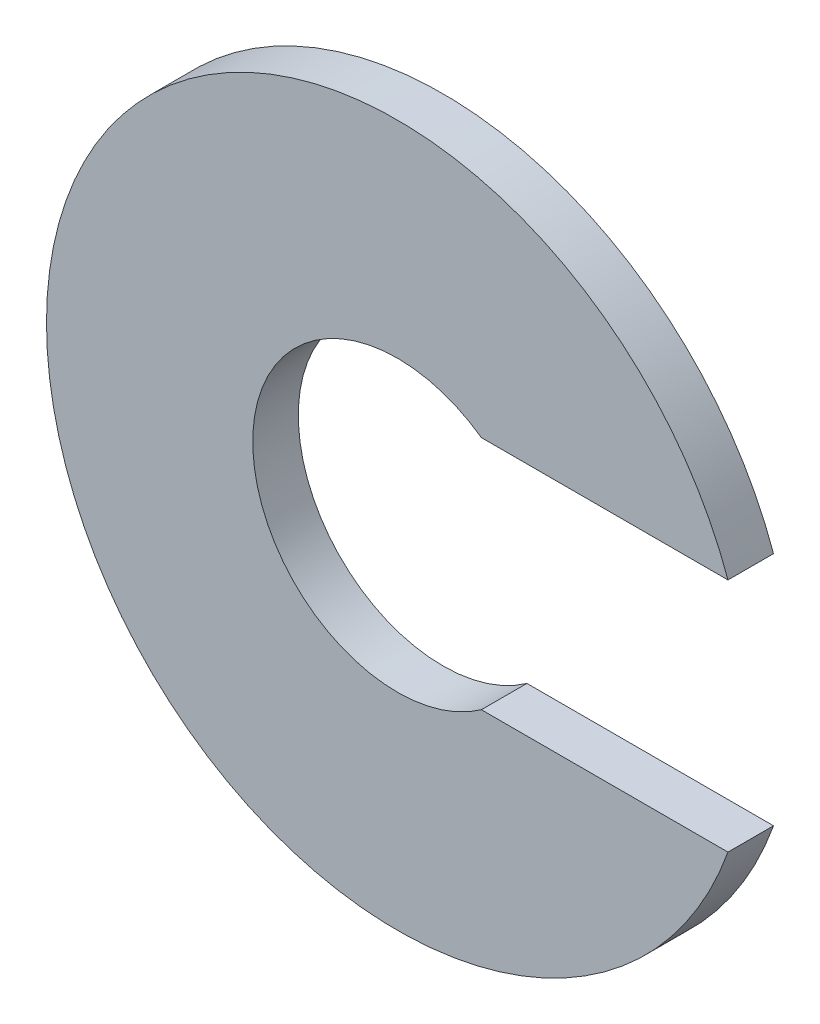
ISO-10303-21;
HEADER;
FILE_DESCRIPTION(('STEP AP214'),'2;1');
FILE_NAME('part.step','',(''),(''),'','','');
FILE_SCHEMA(('AUTOMOTIVE_DESIGN { 1 0 10303 214 1 1 1 1 }'));
ENDSEC;
DATA;
#1=APPLICATION_CONTEXT('core data for automotive mechanical design processes');
#2=APPLICATION_PROTOCOL_DEFINITION('international standard','automotive_design',2000,#1);
#3=PRODUCT_CONTEXT('',#1,'mechanical');
#4=PRODUCT('Part','Part','',(#3));
#5=PRODUCT_RELATED_PRODUCT_CATEGORY('part','',(#4));
#6=PRODUCT_DEFINITION_FORMATION('','',#4);
#7=PRODUCT_DEFINITION_CONTEXT('part definition',#1,'design');
#8=PRODUCT_DEFINITION('design','',#6,#7);
#9=PRODUCT_DEFINITION_SHAPE('','',#8);
#10=(LENGTH_UNIT() NAMED_UNIT(*) SI_UNIT(.MILLI.,.METRE.));
#11=(NAMED_UNIT(*) PLANE_ANGLE_UNIT() SI_UNIT($,.RADIAN.));
#12=(NAMED_UNIT(*) SI_UNIT($,.STERADIAN.) SOLID_ANGLE_UNIT());
#13=UNCERTAINTY_MEASURE_WITH_UNIT(LENGTH_MEASURE(1.E-05),#10,'distance_accuracy_value','');
#14=(GEOMETRIC_REPRESENTATION_CONTEXT(3) GLOBAL_UNCERTAINTY_ASSIGNED_CONTEXT((#13)) GLOBAL_UNIT_ASSIGNED_CONTEXT((#10,
#11,#12)) REPRESENTATION_CONTEXT('',''));
#15=CARTESIAN_POINT('',(0.,0.,0.));
#16=DIRECTION('',(0.,0.,1.));
#17=DIRECTION('',(1.,0.,0.));
#18=AXIS2_PLACEMENT_3D('',#15,#16,#17);
#19=CARTESIAN_POINT('',(0.,0.,0.740000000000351));
#20=DIRECTION('',(0.,0.,1.));
#21=DIRECTION('',(-1.00000000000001,0.,0.));
#22=AXIS2_PLACEMENT_3D('',#19,#20,#21);
#23=PLANE('',#22);
#24=CARTESIAN_POINT('',(0.,0.,0.740000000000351));
#25=DIRECTION('',(0.,0.,1.));
#26=DIRECTION('',(1.,0.,0.));
#27=AXIS2_PLACEMENT_3D('',#24,#25,#26);
#28=CIRCLE('',#27,2.35000000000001);
#29=CARTESIAN_POINT('',(1.36381816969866,1.91376592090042,0.740000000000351));
#30=VERTEX_POINT('',#29);
#31=CARTESIAN_POINT('',(1.36381816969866,-1.91376592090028,0.740000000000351));
#32=VERTEX_POINT('',#31);
#33=EDGE_CURVE('E42',#30,#32,#28,.T.);
#34=ORIENTED_EDGE('',*,*,#33,.F.);
#35=DIRECTION('',(1.,0.,0.));
#36=VECTOR('',#35,1.);
#37=CARTESIAN_POINT('',(1.36381816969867,1.91376592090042,0.740000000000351));
#38=LINE('',#37,#36);
#39=CARTESIAN_POINT('',(5.36912469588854,1.91376592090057,0.740000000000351));
#40=VERTEX_POINT('',#39);
#41=EDGE_CURVE('E65',#30,#40,#38,.T.);
#42=ORIENTED_EDGE('',*,*,#41,.T.);
#43=CARTESIAN_POINT('',(0.,0.,0.740000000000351));
#44=DIRECTION('',(0.,0.,1.));
#45=DIRECTION('',(1.,0.,0.));
#46=AXIS2_PLACEMENT_3D('',#43,#44,#45);
#47=CIRCLE('',#46,5.7);
#48=CARTESIAN_POINT('',(5.36912469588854,-1.91376592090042,0.740000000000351));
#49=VERTEX_POINT('',#48);
#50=EDGE_CURVE('E70',#40,#49,#47,.T.);
#51=ORIENTED_EDGE('',*,*,#50,.T.);
#52=DIRECTION('',(1.,0.,0.));
#53=VECTOR('',#52,1.);
#54=CARTESIAN_POINT('',(1.36381816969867,-1.91376592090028,0.740000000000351));
#55=LINE('',#54,#53);
#56=EDGE_CURVE('E85',#32,#49,#55,.T.);
#57=ORIENTED_EDGE('',*,*,#56,.F.);
#58=EDGE_LOOP('',(#34,#42,#51,#57));
#59=FACE_BOUND('',#58,.T.);
#60=ADVANCED_FACE('F34',(#59),#23,.T.);
#61=CARTESIAN_POINT('',(0.,0.,0.));
#62=DIRECTION('',(0.,0.,1.));
#63=DIRECTION('',(1.,0.,0.));
#64=AXIS2_PLACEMENT_3D('',#61,#62,#63);
#65=PLANE('',#64);
#66=CARTESIAN_POINT('',(0.,0.,0.));
#67=DIRECTION('',(0.,0.,1.));
#68=DIRECTION('',(1.,0.,0.));
#69=AXIS2_PLACEMENT_3D('',#66,#67,#68);
#70=CIRCLE('',#69,2.35000000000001);
#71=CARTESIAN_POINT('',(1.36381816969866,1.91376592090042,0.));
#72=VERTEX_POINT('',#71);
#73=CARTESIAN_POINT('',(1.36381816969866,-1.91376592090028,0.));
#74=VERTEX_POINT('',#73);
#75=EDGE_CURVE('E94',#72,#74,#70,.T.);
#76=ORIENTED_EDGE('',*,*,#75,.T.);
#77=DIRECTION('',(1.,0.,0.));
#78=VECTOR('',#77,1.);
#79=CARTESIAN_POINT('',(1.36381816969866,-1.91376592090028,0.));
#80=LINE('',#79,#78);
#81=CARTESIAN_POINT('',(5.36912469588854,-1.91376592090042,0.));
#82=VERTEX_POINT('',#81);
#83=EDGE_CURVE('E83',#74,#82,#80,.T.);
#84=ORIENTED_EDGE('',*,*,#83,.T.);
#85=CARTESIAN_POINT('',(0.,0.,0.));
#86=DIRECTION('',(0.,0.,1.));
#87=DIRECTION('',(1.,0.,0.));
#88=AXIS2_PLACEMENT_3D('',#85,#86,#87);
#89=CIRCLE('',#88,5.7);
#90=CARTESIAN_POINT('',(5.36912469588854,1.91376592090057,0.));
#91=VERTEX_POINT('',#90);
#92=EDGE_CURVE('E87',#91,#82,#89,.T.);
#93=ORIENTED_EDGE('',*,*,#92,.F.);
#94=DIRECTION('',(1.,0.,0.));
#95=VECTOR('',#94,1.);
#96=CARTESIAN_POINT('',(1.36381816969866,1.91376592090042,0.));
#97=LINE('',#96,#95);
#98=EDGE_CURVE('E101',#72,#91,#97,.T.);
#99=ORIENTED_EDGE('',*,*,#98,.F.);
#100=EDGE_LOOP('',(#76,#84,#93,#99));
#101=FACE_BOUND('',#100,.T.);
#102=ADVANCED_FACE('F93',(#101),#65,.F.);
#103=CARTESIAN_POINT('',(1.36381816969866,-1.91376592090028,16.6297929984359));
#104=DIRECTION('',(0.,1.,0.));
#105=DIRECTION('',(-1.,0.,0.));
#106=AXIS2_PLACEMENT_3D('',#103,#104,#105);
#107=PLANE('',#106);
#108=DIRECTION('',(0.,0.,-1.));
#109=VECTOR('',#108,1.);
#110=CARTESIAN_POINT('',(1.36381816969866,-1.91376592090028,16.6297929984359));
#111=LINE('',#110,#109);
#112=EDGE_CURVE('E11',#32,#74,#111,.T.);
#113=ORIENTED_EDGE('',*,*,#112,.F.);
#114=ORIENTED_EDGE('',*,*,#56,.T.);
#115=DIRECTION('',(0.,0.,-1.));
#116=VECTOR('',#115,1.);
#117=CARTESIAN_POINT('',(5.36912469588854,-1.91376592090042,16.6297929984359));
#118=LINE('',#117,#116);
#119=EDGE_CURVE('E80',#49,#82,#118,.T.);
#120=ORIENTED_EDGE('',*,*,#119,.T.);
#121=ORIENTED_EDGE('',*,*,#83,.F.);
#122=EDGE_LOOP('',(#113,#114,#120,#121));
#123=FACE_BOUND('',#122,.T.);
#124=ADVANCED_FACE('F81',(#123),#107,.T.);
#125=CARTESIAN_POINT('',(0.,0.,16.6297929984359));
#126=DIRECTION('',(0.,0.,-1.));
#127=DIRECTION('',(-1.,0.,0.));
#128=AXIS2_PLACEMENT_3D('',#125,#126,#127);
#129=CYLINDRICAL_SURFACE('',#128,5.7);
#130=ORIENTED_EDGE('',*,*,#50,.F.);
#131=DIRECTION('',(0.,0.,-1.));
#132=VECTOR('',#131,1.);
#133=CARTESIAN_POINT('',(5.36912469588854,1.91376592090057,16.6297929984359));
#134=LINE('',#133,#132);
#135=EDGE_CURVE('E75',#40,#91,#134,.T.);
#136=ORIENTED_EDGE('',*,*,#135,.T.);
#137=ORIENTED_EDGE('',*,*,#92,.T.);
#138=ORIENTED_EDGE('',*,*,#119,.F.);
#139=EDGE_LOOP('',(#130,#136,#137,#138));
#140=FACE_BOUND('',#139,.T.);
#141=ADVANCED_FACE('F88',(#140),#129,.T.);
#142=CARTESIAN_POINT('',(1.36381816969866,1.91376592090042,16.6297929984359));
#143=DIRECTION('',(0.,1.,0.));
#144=DIRECTION('',(-1.,0.,0.));
#145=AXIS2_PLACEMENT_3D('',#142,#143,#144);
#146=PLANE('',#145);
#147=ORIENTED_EDGE('',*,*,#41,.F.);
#148=DIRECTION('',(0.,0.,-1.));
#149=VECTOR('',#148,1.);
#150=CARTESIAN_POINT('',(1.36381816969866,1.91376592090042,16.6297929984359));
#151=LINE('',#150,#149);
#152=EDGE_CURVE('E91',#30,#72,#151,.T.);
#153=ORIENTED_EDGE('',*,*,#152,.T.);
#154=ORIENTED_EDGE('',*,*,#98,.T.);
#155=ORIENTED_EDGE('',*,*,#135,.F.);
#156=EDGE_LOOP('',(#147,#153,#154,#155));
#157=FACE_BOUND('',#156,.T.);
#158=ADVANCED_FACE('F107',(#157),#146,.F.);
#159=CARTESIAN_POINT('',(0.,0.,16.6297929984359));
#160=DIRECTION('',(0.,0.,-1.));
#161=DIRECTION('',(-1.,0.,0.));
#162=AXIS2_PLACEMENT_3D('',#159,#160,#161);
#163=CYLINDRICAL_SURFACE('',#162,2.35000000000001);
#164=ORIENTED_EDGE('',*,*,#152,.F.);
#165=ORIENTED_EDGE('',*,*,#33,.T.);
#166=ORIENTED_EDGE('',*,*,#112,.T.);
#167=ORIENTED_EDGE('',*,*,#75,.F.);
#168=EDGE_LOOP('',(#164,#165,#166,#167));
#169=FACE_BOUND('',#168,.T.);
#170=ADVANCED_FACE('F108',(#169),#163,.F.);
#171=CLOSED_SHELL('',(#60,#102,#124,#141,#158,#170));
#172=MANIFOLD_SOLID_BREP('B2',#171);
#173=ADVANCED_BREP_SHAPE_REPRESENTATION('',(#18,#172),#14);
#174=SHAPE_DEFINITION_REPRESENTATION(#9,#173);
ENDSEC;
END-ISO-10303-21;
